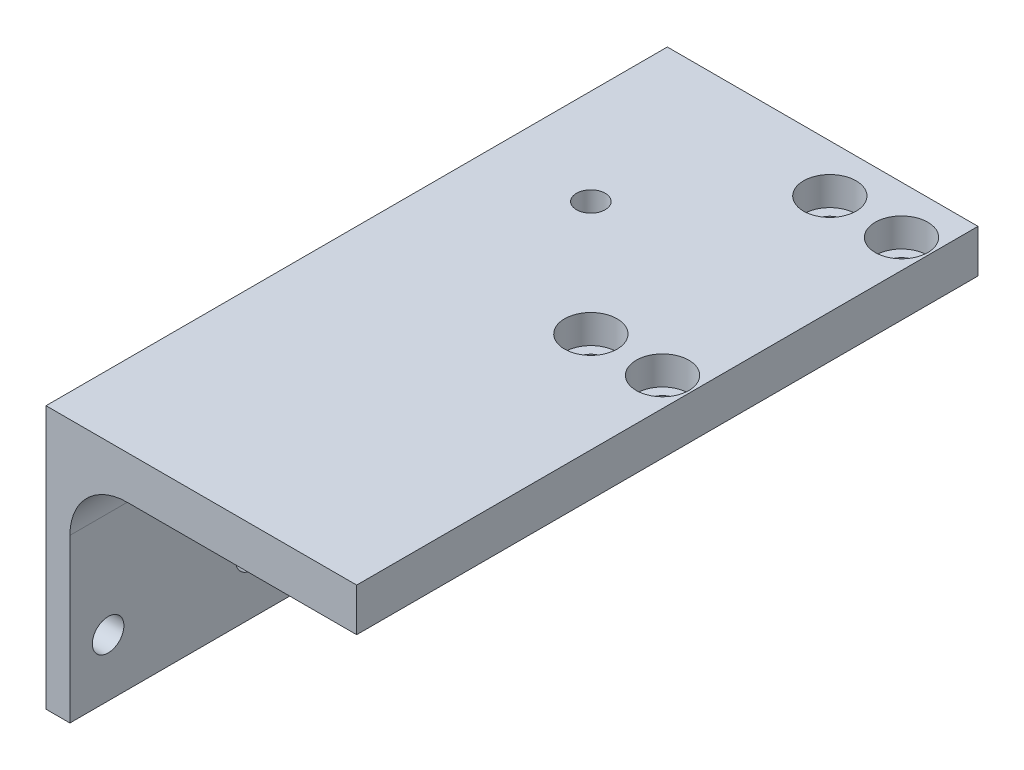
ISO-10303-21;
HEADER;
FILE_DESCRIPTION(('STEP AP214'),'2;1');
FILE_NAME('part.step','',(''),(''),'','','');
FILE_SCHEMA(('AUTOMOTIVE_DESIGN { 1 0 10303 214 1 1 1 1 }'));
ENDSEC;
DATA;
#1=APPLICATION_CONTEXT('core data for automotive mechanical design processes');
#2=APPLICATION_PROTOCOL_DEFINITION('international standard','automotive_design',2000,#1);
#3=PRODUCT_CONTEXT('',#1,'mechanical');
#4=PRODUCT('Part','Part','',(#3));
#5=PRODUCT_RELATED_PRODUCT_CATEGORY('part','',(#4));
#6=PRODUCT_DEFINITION_FORMATION('','',#4);
#7=PRODUCT_DEFINITION_CONTEXT('part definition',#1,'design');
#8=PRODUCT_DEFINITION('design','',#6,#7);
#9=PRODUCT_DEFINITION_SHAPE('','',#8);
#10=(LENGTH_UNIT() NAMED_UNIT(*) SI_UNIT(.MILLI.,.METRE.));
#11=(NAMED_UNIT(*) PLANE_ANGLE_UNIT() SI_UNIT($,.RADIAN.));
#12=(NAMED_UNIT(*) SI_UNIT($,.STERADIAN.) SOLID_ANGLE_UNIT());
#13=UNCERTAINTY_MEASURE_WITH_UNIT(LENGTH_MEASURE(1.E-05),#10,'distance_accuracy_value','');
#14=(GEOMETRIC_REPRESENTATION_CONTEXT(3) GLOBAL_UNCERTAINTY_ASSIGNED_CONTEXT((#13)) GLOBAL_UNIT_ASSIGNED_CONTEXT((#10,
#11,#12)) REPRESENTATION_CONTEXT('',''));
#15=CARTESIAN_POINT('',(0.,0.,0.));
#16=DIRECTION('',(0.,0.,1.));
#17=DIRECTION('',(1.,0.,0.));
#18=AXIS2_PLACEMENT_3D('',#15,#16,#17);
#19=CARTESIAN_POINT('',(65.,70.,65.));
#20=DIRECTION('',(-1.,0.,0.));
#21=DIRECTION('',(0.,-1.,0.));
#22=AXIS2_PLACEMENT_3D('',#19,#20,#21);
#23=PLANE('',#22);
#24=DIRECTION('',(0.,1.,0.));
#25=VECTOR('',#24,1.);
#26=CARTESIAN_POINT('',(65.,70.,-65.));
#27=LINE('',#26,#25);
#28=CARTESIAN_POINT('',(65.,61.,-65.));
#29=VERTEX_POINT('',#28);
#30=CARTESIAN_POINT('',(65.,70.,-65.));
#31=VERTEX_POINT('',#30);
#32=EDGE_CURVE('E435',#29,#31,#27,.T.);
#33=ORIENTED_EDGE('',*,*,#32,.T.);
#34=DIRECTION('',(0.,0.,-1.));
#35=VECTOR('',#34,1.);
#36=CARTESIAN_POINT('',(65.,70.,65.));
#37=LINE('',#36,#35);
#38=CARTESIAN_POINT('',(65.,70.,65.));
#39=VERTEX_POINT('',#38);
#40=EDGE_CURVE('E465',#39,#31,#37,.T.);
#41=ORIENTED_EDGE('',*,*,#40,.F.);
#42=DIRECTION('',(0.,1.,0.));
#43=VECTOR('',#42,1.);
#44=CARTESIAN_POINT('',(65.,70.,65.));
#45=LINE('',#44,#43);
#46=CARTESIAN_POINT('',(65.,61.,65.));
#47=VERTEX_POINT('',#46);
#48=EDGE_CURVE('E455',#47,#39,#45,.T.);
#49=ORIENTED_EDGE('',*,*,#48,.F.);
#50=DIRECTION('',(0.,0.,-1.));
#51=VECTOR('',#50,1.);
#52=CARTESIAN_POINT('',(65.,61.,65.));
#53=LINE('',#52,#51);
#54=EDGE_CURVE('E460',#47,#29,#53,.T.);
#55=ORIENTED_EDGE('',*,*,#54,.T.);
#56=EDGE_LOOP('',(#33,#41,#49,#55));
#57=FACE_BOUND('',#56,.T.);
#58=ADVANCED_FACE('F369',(#57),#23,.F.);
#59=CARTESIAN_POINT('',(65.,70.,65.));
#60=DIRECTION('',(0.,-1.,0.));
#61=DIRECTION('',(0.,0.,-1.));
#62=AXIS2_PLACEMENT_3D('',#59,#60,#61);
#63=PLANE('',#62);
#64=CARTESIAN_POINT('',(20.,70.0000000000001,-29.));
#65=DIRECTION('',(0.,-1.,0.));
#66=DIRECTION('',(0.,0.,-1.));
#67=AXIS2_PLACEMENT_3D('',#64,#65,#66);
#68=CIRCLE('',#67,3.);
#69=CARTESIAN_POINT('',(20.,70.0000000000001,-32.));
#70=VERTEX_POINT('',#69);
#71=EDGE_CURVE('E560',#70,#70,#68,.T.);
#72=ORIENTED_EDGE('',*,*,#71,.T.);
#73=EDGE_LOOP('',(#72));
#74=FACE_BOUND('',#73,.T.);
#75=CARTESIAN_POINT('',(59.,70.,-55.));
#76=DIRECTION('',(0.,1.,0.));
#77=DIRECTION('',(0.,0.,1.));
#78=AXIS2_PLACEMENT_3D('',#75,#76,#77);
#79=CIRCLE('',#78,5.49999999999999);
#80=CARTESIAN_POINT('',(59.,70.,-49.5));
#81=VERTEX_POINT('',#80);
#82=EDGE_CURVE('E506',#81,#81,#79,.T.);
#83=ORIENTED_EDGE('',*,*,#82,.F.);
#84=EDGE_LOOP('',(#83));
#85=FACE_BOUND('',#84,.T.);
#86=CARTESIAN_POINT('',(59.,70.,-5.));
#87=DIRECTION('',(0.,1.,0.));
#88=DIRECTION('',(0.,0.,1.));
#89=AXIS2_PLACEMENT_3D('',#86,#87,#88);
#90=CIRCLE('',#89,5.5);
#91=CARTESIAN_POINT('',(59.,70.,0.5));
#92=VERTEX_POINT('',#91);
#93=EDGE_CURVE('E493',#92,#92,#90,.T.);
#94=ORIENTED_EDGE('',*,*,#93,.F.);
#95=EDGE_LOOP('',(#94));
#96=FACE_BOUND('',#95,.T.);
#97=CARTESIAN_POINT('',(44.,70.,-5.));
#98=DIRECTION('',(0.,1.,0.));
#99=DIRECTION('',(0.,0.,1.));
#100=AXIS2_PLACEMENT_3D('',#97,#98,#99);
#101=CIRCLE('',#100,5.5);
#102=CARTESIAN_POINT('',(44.,70.,0.5));
#103=VERTEX_POINT('',#102);
#104=EDGE_CURVE('E489',#103,#103,#101,.T.);
#105=ORIENTED_EDGE('',*,*,#104,.F.);
#106=EDGE_LOOP('',(#105));
#107=FACE_BOUND('',#106,.T.);
#108=CARTESIAN_POINT('',(44.,70.,-55.));
#109=DIRECTION('',(0.,1.,0.));
#110=DIRECTION('',(0.,0.,1.));
#111=AXIS2_PLACEMENT_3D('',#108,#109,#110);
#112=CIRCLE('',#111,5.49999999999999);
#113=CARTESIAN_POINT('',(44.,70.,-49.5));
#114=VERTEX_POINT('',#113);
#115=EDGE_CURVE('E485',#114,#114,#112,.T.);
#116=ORIENTED_EDGE('',*,*,#115,.F.);
#117=EDGE_LOOP('',(#116));
#118=FACE_BOUND('',#117,.T.);
#119=DIRECTION('',(-1.,0.,0.));
#120=VECTOR('',#119,1.);
#121=CARTESIAN_POINT('',(65.,70.,-65.));
#122=LINE('',#121,#120);
#123=CARTESIAN_POINT('',(0.,70.,-65.));
#124=VERTEX_POINT('',#123);
#125=EDGE_CURVE('E531',#31,#124,#122,.T.);
#126=ORIENTED_EDGE('',*,*,#125,.T.);
#127=DIRECTION('',(0.,0.,-1.));
#128=VECTOR('',#127,1.);
#129=CARTESIAN_POINT('',(0.,70.,65.));
#130=LINE('',#129,#128);
#131=CARTESIAN_POINT('',(0.,70.,65.));
#132=VERTEX_POINT('',#131);
#133=EDGE_CURVE('E463',#132,#124,#130,.T.);
#134=ORIENTED_EDGE('',*,*,#133,.F.);
#135=DIRECTION('',(-1.,0.,0.));
#136=VECTOR('',#135,1.);
#137=CARTESIAN_POINT('',(65.,70.,65.));
#138=LINE('',#137,#136);
#139=EDGE_CURVE('E449',#39,#132,#138,.T.);
#140=ORIENTED_EDGE('',*,*,#139,.F.);
#141=ORIENTED_EDGE('',*,*,#40,.T.);
#142=EDGE_LOOP('',(#126,#134,#140,#141));
#143=FACE_BOUND('',#142,.T.);
#144=ADVANCED_FACE('F544',(#74,#85,#96,#107,#118,#143),#63,.F.);
#145=CARTESIAN_POINT('',(0.,70.,65.));
#146=DIRECTION('',(1.,0.,0.));
#147=DIRECTION('',(0.,0.,-1.));
#148=AXIS2_PLACEMENT_3D('',#145,#146,#147);
#149=PLANE('',#148);
#150=CARTESIAN_POINT('',(0.,47.,37.));
#151=DIRECTION('',(-1.,0.,0.));
#152=DIRECTION('',(0.,0.,1.));
#153=AXIS2_PLACEMENT_3D('',#150,#151,#152);
#154=CIRCLE('',#153,1.5);
#155=CARTESIAN_POINT('',(0.,47.,38.5));
#156=VERTEX_POINT('',#155);
#157=EDGE_CURVE('E566',#156,#156,#154,.T.);
#158=ORIENTED_EDGE('',*,*,#157,.F.);
#159=EDGE_LOOP('',(#158));
#160=FACE_BOUND('',#159,.T.);
#161=CARTESIAN_POINT('',(0.,27.,57.));
#162=DIRECTION('',(1.,0.,0.));
#163=DIRECTION('',(0.,0.,-1.));
#164=AXIS2_PLACEMENT_3D('',#161,#162,#163);
#165=CIRCLE('',#164,3.3);
#166=CARTESIAN_POINT('',(0.,27.,53.7));
#167=VERTEX_POINT('',#166);
#168=EDGE_CURVE('E571',#167,#167,#165,.T.);
#169=ORIENTED_EDGE('',*,*,#168,.T.);
#170=EDGE_LOOP('',(#169));
#171=FACE_BOUND('',#170,.T.);
#172=CARTESIAN_POINT('',(0.,27.,27.));
#173=DIRECTION('',(1.,0.,0.));
#174=DIRECTION('',(0.,0.,-1.));
#175=AXIS2_PLACEMENT_3D('',#172,#173,#174);
#176=CIRCLE('',#175,3.3);
#177=CARTESIAN_POINT('',(0.,27.,23.7));
#178=VERTEX_POINT('',#177);
#179=EDGE_CURVE('E577',#178,#178,#176,.T.);
#180=ORIENTED_EDGE('',*,*,#179,.T.);
#181=EDGE_LOOP('',(#180));
#182=FACE_BOUND('',#181,.T.);
#183=DIRECTION('',(0.,-1.,0.));
#184=VECTOR('',#183,1.);
#185=CARTESIAN_POINT('',(0.,70.,-65.));
#186=LINE('',#185,#184);
#187=CARTESIAN_POINT('',(0.,15.,-65.));
#188=VERTEX_POINT('',#187);
#189=EDGE_CURVE('E444',#124,#188,#186,.T.);
#190=ORIENTED_EDGE('',*,*,#189,.T.);
#191=DIRECTION('',(0.,0.,1.));
#192=VECTOR('',#191,1.);
#193=CARTESIAN_POINT('',(0.,15.,107.536267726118));
#194=LINE('',#193,#192);
#195=CARTESIAN_POINT('',(0.,15.,65.));
#196=VERTEX_POINT('',#195);
#197=EDGE_CURVE('E389',#188,#196,#194,.T.);
#198=ORIENTED_EDGE('',*,*,#197,.T.);
#199=DIRECTION('',(0.,-1.,0.));
#200=VECTOR('',#199,1.);
#201=CARTESIAN_POINT('',(0.,70.,65.));
#202=LINE('',#201,#200);
#203=EDGE_CURVE('E442',#132,#196,#202,.T.);
#204=ORIENTED_EDGE('',*,*,#203,.F.);
#205=ORIENTED_EDGE('',*,*,#133,.T.);
#206=EDGE_LOOP('',(#190,#198,#204,#205));
#207=FACE_BOUND('',#206,.T.);
#208=ADVANCED_FACE('F440',(#160,#171,#182,#207),#149,.F.);
#209=CARTESIAN_POINT('',(5.00000000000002,61.,65.));
#210=DIRECTION('',(-1.,0.,0.));
#211=DIRECTION('',(0.,0.,1.));
#212=AXIS2_PLACEMENT_3D('',#209,#210,#211);
#213=PLANE('',#212);
#214=CARTESIAN_POINT('',(5.00000000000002,47.,37.));
#215=DIRECTION('',(-1.,0.,0.));
#216=DIRECTION('',(0.,0.,1.));
#217=AXIS2_PLACEMENT_3D('',#214,#215,#216);
#218=CIRCLE('',#217,1.5);
#219=CARTESIAN_POINT('',(5.00000000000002,47.,38.5));
#220=VERTEX_POINT('',#219);
#221=EDGE_CURVE('E372',#220,#220,#218,.T.);
#222=ORIENTED_EDGE('',*,*,#221,.T.);
#223=EDGE_LOOP('',(#222));
#224=FACE_BOUND('',#223,.T.);
#225=CARTESIAN_POINT('',(5.00000000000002,27.,57.));
#226=DIRECTION('',(1.,0.,0.));
#227=DIRECTION('',(0.,0.,-1.));
#228=AXIS2_PLACEMENT_3D('',#225,#226,#227);
#229=CIRCLE('',#228,3.3);
#230=CARTESIAN_POINT('',(5.00000000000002,27.,53.7));
#231=VERTEX_POINT('',#230);
#232=EDGE_CURVE('E563',#231,#231,#229,.T.);
#233=ORIENTED_EDGE('',*,*,#232,.F.);
#234=EDGE_LOOP('',(#233));
#235=FACE_BOUND('',#234,.T.);
#236=CARTESIAN_POINT('',(5.00000000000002,27.,27.));
#237=DIRECTION('',(1.,0.,0.));
#238=DIRECTION('',(0.,0.,-1.));
#239=AXIS2_PLACEMENT_3D('',#236,#237,#238);
#240=CIRCLE('',#239,3.3);
#241=CARTESIAN_POINT('',(5.00000000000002,27.,23.7));
#242=VERTEX_POINT('',#241);
#243=EDGE_CURVE('E574',#242,#242,#240,.T.);
#244=ORIENTED_EDGE('',*,*,#243,.F.);
#245=EDGE_LOOP('',(#244));
#246=FACE_BOUND('',#245,.T.);
#247=DIRECTION('',(0.,1.,0.));
#248=VECTOR('',#247,1.);
#249=CARTESIAN_POINT('',(5.00000000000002,61.,65.));
#250=LINE('',#249,#248);
#251=CARTESIAN_POINT('',(5.00000000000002,15.,65.));
#252=VERTEX_POINT('',#251);
#253=CARTESIAN_POINT('',(5.00000000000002,49.,65.));
#254=VERTEX_POINT('',#253);
#255=EDGE_CURVE('E451',#252,#254,#250,.T.);
#256=ORIENTED_EDGE('',*,*,#255,.F.);
#257=DIRECTION('',(0.,0.,-1.));
#258=VECTOR('',#257,1.);
#259=CARTESIAN_POINT('',(5.00000000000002,15.,65.));
#260=LINE('',#259,#258);
#261=CARTESIAN_POINT('',(5.00000000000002,15.,-65.));
#262=VERTEX_POINT('',#261);
#263=EDGE_CURVE('E431',#252,#262,#260,.T.);
#264=ORIENTED_EDGE('',*,*,#263,.T.);
#265=DIRECTION('',(0.,1.,0.));
#266=VECTOR('',#265,1.);
#267=CARTESIAN_POINT('',(5.00000000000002,61.,-65.));
#268=LINE('',#267,#266);
#269=CARTESIAN_POINT('',(5.00000000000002,49.,-65.));
#270=VERTEX_POINT('',#269);
#271=EDGE_CURVE('E534',#262,#270,#268,.T.);
#272=ORIENTED_EDGE('',*,*,#271,.T.);
#273=DIRECTION('',(0.,0.,-1.));
#274=VECTOR('',#273,1.);
#275=CARTESIAN_POINT('',(5.00000000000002,49.,65.));
#276=LINE('',#275,#274);
#277=EDGE_CURVE('E468',#270,#254,#276,.F.);
#278=ORIENTED_EDGE('',*,*,#277,.T.);
#279=EDGE_LOOP('',(#256,#264,#272,#278));
#280=FACE_BOUND('',#279,.T.);
#281=ADVANCED_FACE('F549',(#224,#235,#246,#280),#213,.F.);
#282=CARTESIAN_POINT('',(65.,61.,65.));
#283=DIRECTION('',(0.,1.,0.));
#284=DIRECTION('',(-1.,0.,0.));
#285=AXIS2_PLACEMENT_3D('',#282,#283,#284);
#286=PLANE('',#285);
#287=CARTESIAN_POINT('',(59.,61.,-55.));
#288=DIRECTION('',(0.,1.,0.));
#289=DIRECTION('',(-1.,0.,0.));
#290=AXIS2_PLACEMENT_3D('',#287,#288,#289);
#291=CIRCLE('',#290,3.29999999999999);
#292=CARTESIAN_POINT('',(55.7,61.,-55.));
#293=VERTEX_POINT('',#292);
#294=EDGE_CURVE('E491',#293,#293,#291,.T.);
#295=ORIENTED_EDGE('',*,*,#294,.T.);
#296=EDGE_LOOP('',(#295));
#297=FACE_BOUND('',#296,.T.);
#298=CARTESIAN_POINT('',(59.,61.,-5.));
#299=DIRECTION('',(0.,1.,0.));
#300=DIRECTION('',(-1.,0.,0.));
#301=AXIS2_PLACEMENT_3D('',#298,#299,#300);
#302=CIRCLE('',#301,3.29999999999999);
#303=CARTESIAN_POINT('',(55.7,61.,-5.));
#304=VERTEX_POINT('',#303);
#305=EDGE_CURVE('E487',#304,#304,#302,.T.);
#306=ORIENTED_EDGE('',*,*,#305,.T.);
#307=EDGE_LOOP('',(#306));
#308=FACE_BOUND('',#307,.T.);
#309=CARTESIAN_POINT('',(44.,61.,-5.));
#310=DIRECTION('',(0.,1.,0.));
#311=DIRECTION('',(-1.,0.,0.));
#312=AXIS2_PLACEMENT_3D('',#309,#310,#311);
#313=CIRCLE('',#312,3.29999999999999);
#314=CARTESIAN_POINT('',(40.7,61.,-5.));
#315=VERTEX_POINT('',#314);
#316=EDGE_CURVE('E482',#315,#315,#313,.T.);
#317=ORIENTED_EDGE('',*,*,#316,.T.);
#318=EDGE_LOOP('',(#317));
#319=FACE_BOUND('',#318,.T.);
#320=CARTESIAN_POINT('',(44.,61.,-55.));
#321=DIRECTION('',(0.,1.,0.));
#322=DIRECTION('',(-1.,0.,0.));
#323=AXIS2_PLACEMENT_3D('',#320,#321,#322);
#324=CIRCLE('',#323,3.29999999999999);
#325=CARTESIAN_POINT('',(40.7,61.,-55.));
#326=VERTEX_POINT('',#325);
#327=EDGE_CURVE('E445',#326,#326,#324,.T.);
#328=ORIENTED_EDGE('',*,*,#327,.T.);
#329=EDGE_LOOP('',(#328));
#330=FACE_BOUND('',#329,.T.);
#331=DIRECTION('',(0.,0.,-1.));
#332=VECTOR('',#331,1.);
#333=CARTESIAN_POINT('',(17.,61.,-65.));
#334=LINE('',#333,#332);
#335=CARTESIAN_POINT('',(17.,61.,65.));
#336=VERTEX_POINT('',#335);
#337=CARTESIAN_POINT('',(17.,61.,-29.));
#338=VERTEX_POINT('',#337);
#339=EDGE_CURVE('E472',#336,#338,#334,.T.);
#340=ORIENTED_EDGE('',*,*,#339,.T.);
#341=CARTESIAN_POINT('',(20.,61.,-29.));
#342=DIRECTION('',(0.,-1.,0.));
#343=DIRECTION('',(0.,0.,-1.));
#344=AXIS2_PLACEMENT_3D('',#341,#342,#343);
#345=CIRCLE('',#344,3.);
#346=EDGE_CURVE('E383',#338,#338,#345,.T.);
#347=ORIENTED_EDGE('',*,*,#346,.F.);
#348=CARTESIAN_POINT('',(17.,61.,-65.));
#349=VERTEX_POINT('',#348);
#350=EDGE_CURVE('E471',#338,#349,#334,.T.);
#351=ORIENTED_EDGE('',*,*,#350,.T.);
#352=DIRECTION('',(1.,0.,0.));
#353=VECTOR('',#352,1.);
#354=CARTESIAN_POINT('',(65.,61.,-65.));
#355=LINE('',#354,#353);
#356=EDGE_CURVE('E536',#349,#29,#355,.T.);
#357=ORIENTED_EDGE('',*,*,#356,.T.);
#358=ORIENTED_EDGE('',*,*,#54,.F.);
#359=DIRECTION('',(1.,0.,0.));
#360=VECTOR('',#359,1.);
#361=CARTESIAN_POINT('',(65.,61.,65.));
#362=LINE('',#361,#360);
#363=EDGE_CURVE('E453',#336,#47,#362,.T.);
#364=ORIENTED_EDGE('',*,*,#363,.F.);
#365=EDGE_LOOP('',(#340,#347,#351,#357,#358,#364));
#366=FACE_BOUND('',#365,.T.);
#367=ADVANCED_FACE('F555',(#297,#308,#319,#330,#366),#286,.F.);
#368=CARTESIAN_POINT('',(65.0000000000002,-61.,65.));
#369=DIRECTION('',(0.,0.,-1.));
#370=DIRECTION('',(-1.,0.,0.));
#371=AXIS2_PLACEMENT_3D('',#368,#369,#370);
#372=PLANE('',#371);
#373=ORIENTED_EDGE('',*,*,#203,.T.);
#374=DIRECTION('',(1.,0.,0.));
#375=VECTOR('',#374,1.);
#376=CARTESIAN_POINT('',(65.0000000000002,15.,65.));
#377=LINE('',#376,#375);
#378=EDGE_CURVE('E428',#196,#252,#377,.T.);
#379=ORIENTED_EDGE('',*,*,#378,.T.);
#380=ORIENTED_EDGE('',*,*,#255,.T.);
#381=CARTESIAN_POINT('',(17.,49.,65.));
#382=DIRECTION('',(0.,0.,-1.));
#383=DIRECTION('',(-1.,0.,0.));
#384=AXIS2_PLACEMENT_3D('',#381,#382,#383);
#385=CIRCLE('',#384,12.);
#386=EDGE_CURVE('E377',#254,#336,#385,.T.);
#387=ORIENTED_EDGE('',*,*,#386,.T.);
#388=ORIENTED_EDGE('',*,*,#363,.T.);
#389=ORIENTED_EDGE('',*,*,#48,.T.);
#390=ORIENTED_EDGE('',*,*,#139,.T.);
#391=EDGE_LOOP('',(#373,#379,#380,#387,#388,#389,#390));
#392=FACE_BOUND('',#391,.T.);
#393=ADVANCED_FACE('F447',(#392),#372,.F.);
#394=CARTESIAN_POINT('',(65.0000000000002,-61.,-65.));
#395=DIRECTION('',(0.,0.,-1.));
#396=DIRECTION('',(-1.,0.,0.));
#397=AXIS2_PLACEMENT_3D('',#394,#395,#396);
#398=PLANE('',#397);
#399=DIRECTION('',(1.,0.,0.));
#400=VECTOR('',#399,1.);
#401=CARTESIAN_POINT('',(65.0000000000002,15.,-65.));
#402=LINE('',#401,#400);
#403=EDGE_CURVE('E11',#188,#262,#402,.T.);
#404=ORIENTED_EDGE('',*,*,#403,.F.);
#405=ORIENTED_EDGE('',*,*,#189,.F.);
#406=ORIENTED_EDGE('',*,*,#125,.F.);
#407=ORIENTED_EDGE('',*,*,#32,.F.);
#408=ORIENTED_EDGE('',*,*,#356,.F.);
#409=CARTESIAN_POINT('',(17.,49.,-65.));
#410=DIRECTION('',(0.,0.,-1.));
#411=DIRECTION('',(-1.,0.,0.));
#412=AXIS2_PLACEMENT_3D('',#409,#410,#411);
#413=CIRCLE('',#412,12.);
#414=EDGE_CURVE('E475',#349,#270,#413,.F.);
#415=ORIENTED_EDGE('',*,*,#414,.T.);
#416=ORIENTED_EDGE('',*,*,#271,.F.);
#417=EDGE_LOOP('',(#404,#405,#406,#407,#408,#415,#416));
#418=FACE_BOUND('',#417,.T.);
#419=ADVANCED_FACE('F546',(#418),#398,.T.);
#420=CARTESIAN_POINT('',(17.,49.,65.));
#421=DIRECTION('',(0.,0.,1.));
#422=DIRECTION('',(1.,0.,0.));
#423=AXIS2_PLACEMENT_3D('',#420,#421,#422);
#424=CYLINDRICAL_SURFACE('',#423,12.);
#425=ORIENTED_EDGE('',*,*,#386,.F.);
#426=ORIENTED_EDGE('',*,*,#277,.F.);
#427=ORIENTED_EDGE('',*,*,#414,.F.);
#428=ORIENTED_EDGE('',*,*,#350,.F.);
#429=ORIENTED_EDGE('',*,*,#339,.F.);
#430=EDGE_LOOP('',(#425,#426,#427,#428,#429));
#431=FACE_BOUND('',#430,.T.);
#432=ADVANCED_FACE('F557',(#431),#424,.F.);
#433=CARTESIAN_POINT('',(0.,15.,107.536267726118));
#434=DIRECTION('',(0.,1.,0.));
#435=DIRECTION('',(0.,0.,1.));
#436=AXIS2_PLACEMENT_3D('',#433,#434,#435);
#437=PLANE('',#436);
#438=ORIENTED_EDGE('',*,*,#197,.F.);
#439=ORIENTED_EDGE('',*,*,#403,.T.);
#440=ORIENTED_EDGE('',*,*,#263,.F.);
#441=ORIENTED_EDGE('',*,*,#378,.F.);
#442=EDGE_LOOP('',(#438,#439,#440,#441));
#443=FACE_BOUND('',#442,.T.);
#444=ADVANCED_FACE('F429',(#443),#437,.F.);
#445=CARTESIAN_POINT('',(44.,70.,-55.));
#446=DIRECTION('',(0.,1.,0.));
#447=DIRECTION('',(0.,0.,1.));
#448=AXIS2_PLACEMENT_3D('',#445,#446,#447);
#449=CYLINDRICAL_SURFACE('',#448,3.29999999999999);
#450=CARTESIAN_POINT('',(44.,64.,-55.));
#451=DIRECTION('',(0.,1.,0.));
#452=DIRECTION('',(0.,0.,1.));
#453=AXIS2_PLACEMENT_3D('',#450,#451,#452);
#454=CIRCLE('',#453,3.3);
#455=CARTESIAN_POINT('',(44.,64.,-51.7));
#456=VERTEX_POINT('',#455);
#457=EDGE_CURVE('E481',#456,#456,#454,.T.);
#458=ORIENTED_EDGE('',*,*,#457,.T.);
#459=EDGE_LOOP('',(#458));
#460=FACE_BOUND('',#459,.T.);
#461=ORIENTED_EDGE('',*,*,#327,.F.);
#462=EDGE_LOOP('',(#461));
#463=FACE_BOUND('',#462,.T.);
#464=ADVANCED_FACE('F606',(#460,#463),#449,.F.);
#465=CARTESIAN_POINT('',(47.3,64.,-55.));
#466=DIRECTION('',(0.,-1.,0.));
#467=DIRECTION('',(0.,0.,-1.));
#468=AXIS2_PLACEMENT_3D('',#465,#466,#467);
#469=PLANE('',#468);
#470=ORIENTED_EDGE('',*,*,#457,.F.);
#471=EDGE_LOOP('',(#470));
#472=FACE_BOUND('',#471,.T.);
#473=CARTESIAN_POINT('',(44.,64.,-55.));
#474=DIRECTION('',(0.,1.,0.));
#475=DIRECTION('',(0.,0.,1.));
#476=AXIS2_PLACEMENT_3D('',#473,#474,#475);
#477=CIRCLE('',#476,5.5);
#478=CARTESIAN_POINT('',(44.,64.,-49.5));
#479=VERTEX_POINT('',#478);
#480=EDGE_CURVE('E523',#479,#479,#477,.T.);
#481=ORIENTED_EDGE('',*,*,#480,.T.);
#482=EDGE_LOOP('',(#481));
#483=FACE_BOUND('',#482,.T.);
#484=ADVANCED_FACE('F596',(#472,#483),#469,.F.);
#485=CARTESIAN_POINT('',(44.,70.,-55.));
#486=DIRECTION('',(0.,1.,0.));
#487=DIRECTION('',(0.,0.,1.));
#488=AXIS2_PLACEMENT_3D('',#485,#486,#487);
#489=CYLINDRICAL_SURFACE('',#488,5.49999999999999);
#490=ORIENTED_EDGE('',*,*,#480,.F.);
#491=EDGE_LOOP('',(#490));
#492=FACE_BOUND('',#491,.T.);
#493=ORIENTED_EDGE('',*,*,#115,.T.);
#494=EDGE_LOOP('',(#493));
#495=FACE_BOUND('',#494,.T.);
#496=ADVANCED_FACE('F593',(#492,#495),#489,.F.);
#497=CARTESIAN_POINT('',(44.,70.,-5.));
#498=DIRECTION('',(0.,1.,0.));
#499=DIRECTION('',(0.,0.,1.));
#500=AXIS2_PLACEMENT_3D('',#497,#498,#499);
#501=CYLINDRICAL_SURFACE('',#500,3.29999999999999);
#502=CARTESIAN_POINT('',(44.,64.,-5.));
#503=DIRECTION('',(0.,1.,0.));
#504=DIRECTION('',(0.,0.,1.));
#505=AXIS2_PLACEMENT_3D('',#502,#503,#504);
#506=CIRCLE('',#505,3.3);
#507=CARTESIAN_POINT('',(44.,64.,-1.7));
#508=VERTEX_POINT('',#507);
#509=EDGE_CURVE('E486',#508,#508,#506,.T.);
#510=ORIENTED_EDGE('',*,*,#509,.T.);
#511=EDGE_LOOP('',(#510));
#512=FACE_BOUND('',#511,.T.);
#513=ORIENTED_EDGE('',*,*,#316,.F.);
#514=EDGE_LOOP('',(#513));
#515=FACE_BOUND('',#514,.T.);
#516=ADVANCED_FACE('F595',(#512,#515),#501,.F.);
#517=CARTESIAN_POINT('',(47.3,64.,-5.));
#518=DIRECTION('',(0.,-1.,0.));
#519=DIRECTION('',(0.,0.,-1.));
#520=AXIS2_PLACEMENT_3D('',#517,#518,#519);
#521=PLANE('',#520);
#522=ORIENTED_EDGE('',*,*,#509,.F.);
#523=EDGE_LOOP('',(#522));
#524=FACE_BOUND('',#523,.T.);
#525=CARTESIAN_POINT('',(44.,64.,-5.));
#526=DIRECTION('',(0.,1.,0.));
#527=DIRECTION('',(0.,0.,1.));
#528=AXIS2_PLACEMENT_3D('',#525,#526,#527);
#529=CIRCLE('',#528,5.5);
#530=CARTESIAN_POINT('',(44.,64.,0.5));
#531=VERTEX_POINT('',#530);
#532=EDGE_CURVE('E516',#531,#531,#529,.T.);
#533=ORIENTED_EDGE('',*,*,#532,.T.);
#534=EDGE_LOOP('',(#533));
#535=FACE_BOUND('',#534,.T.);
#536=ADVANCED_FACE('F603',(#524,#535),#521,.F.);
#537=CARTESIAN_POINT('',(44.,70.,-5.));
#538=DIRECTION('',(0.,1.,0.));
#539=DIRECTION('',(0.,0.,1.));
#540=AXIS2_PLACEMENT_3D('',#537,#538,#539);
#541=CYLINDRICAL_SURFACE('',#540,5.5);
#542=ORIENTED_EDGE('',*,*,#532,.F.);
#543=EDGE_LOOP('',(#542));
#544=FACE_BOUND('',#543,.T.);
#545=ORIENTED_EDGE('',*,*,#104,.T.);
#546=EDGE_LOOP('',(#545));
#547=FACE_BOUND('',#546,.T.);
#548=ADVANCED_FACE('F658',(#544,#547),#541,.F.);
#549=CARTESIAN_POINT('',(59.,70.,-5.));
#550=DIRECTION('',(0.,1.,0.));
#551=DIRECTION('',(0.,0.,1.));
#552=AXIS2_PLACEMENT_3D('',#549,#550,#551);
#553=CYLINDRICAL_SURFACE('',#552,3.29999999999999);
#554=CARTESIAN_POINT('',(59.,64.,-5.));
#555=DIRECTION('',(0.,1.,0.));
#556=DIRECTION('',(0.,0.,1.));
#557=AXIS2_PLACEMENT_3D('',#554,#555,#556);
#558=CIRCLE('',#557,3.3);
#559=CARTESIAN_POINT('',(59.,64.,-1.7));
#560=VERTEX_POINT('',#559);
#561=EDGE_CURVE('E490',#560,#560,#558,.T.);
#562=ORIENTED_EDGE('',*,*,#561,.T.);
#563=EDGE_LOOP('',(#562));
#564=FACE_BOUND('',#563,.T.);
#565=ORIENTED_EDGE('',*,*,#305,.F.);
#566=EDGE_LOOP('',(#565));
#567=FACE_BOUND('',#566,.T.);
#568=ADVANCED_FACE('F666',(#564,#567),#553,.F.);
#569=CARTESIAN_POINT('',(62.3,64.,-5.));
#570=DIRECTION('',(0.,-1.,0.));
#571=DIRECTION('',(0.,0.,-1.));
#572=AXIS2_PLACEMENT_3D('',#569,#570,#571);
#573=PLANE('',#572);
#574=ORIENTED_EDGE('',*,*,#561,.F.);
#575=EDGE_LOOP('',(#574));
#576=FACE_BOUND('',#575,.T.);
#577=CARTESIAN_POINT('',(59.,64.,-5.));
#578=DIRECTION('',(0.,1.,0.));
#579=DIRECTION('',(0.,0.,1.));
#580=AXIS2_PLACEMENT_3D('',#577,#578,#579);
#581=CIRCLE('',#580,5.5);
#582=CARTESIAN_POINT('',(59.,64.,0.5));
#583=VERTEX_POINT('',#582);
#584=EDGE_CURVE('E498',#583,#583,#581,.T.);
#585=ORIENTED_EDGE('',*,*,#584,.T.);
#586=EDGE_LOOP('',(#585));
#587=FACE_BOUND('',#586,.T.);
#588=ADVANCED_FACE('F674',(#576,#587),#573,.F.);
#589=CARTESIAN_POINT('',(59.,70.,-5.));
#590=DIRECTION('',(0.,1.,0.));
#591=DIRECTION('',(0.,0.,1.));
#592=AXIS2_PLACEMENT_3D('',#589,#590,#591);
#593=CYLINDRICAL_SURFACE('',#592,5.5);
#594=ORIENTED_EDGE('',*,*,#584,.F.);
#595=EDGE_LOOP('',(#594));
#596=FACE_BOUND('',#595,.T.);
#597=ORIENTED_EDGE('',*,*,#93,.T.);
#598=EDGE_LOOP('',(#597));
#599=FACE_BOUND('',#598,.T.);
#600=ADVANCED_FACE('F682',(#596,#599),#593,.F.);
#601=CARTESIAN_POINT('',(59.,70.,-55.));
#602=DIRECTION('',(0.,1.,0.));
#603=DIRECTION('',(0.,0.,1.));
#604=AXIS2_PLACEMENT_3D('',#601,#602,#603);
#605=CYLINDRICAL_SURFACE('',#604,3.29999999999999);
#606=CARTESIAN_POINT('',(59.,64.,-55.));
#607=DIRECTION('',(0.,1.,0.));
#608=DIRECTION('',(0.,0.,1.));
#609=AXIS2_PLACEMENT_3D('',#606,#607,#608);
#610=CIRCLE('',#609,3.3);
#611=CARTESIAN_POINT('',(59.,64.,-51.7));
#612=VERTEX_POINT('',#611);
#613=EDGE_CURVE('E494',#612,#612,#610,.T.);
#614=ORIENTED_EDGE('',*,*,#613,.T.);
#615=EDGE_LOOP('',(#614));
#616=FACE_BOUND('',#615,.T.);
#617=ORIENTED_EDGE('',*,*,#294,.F.);
#618=EDGE_LOOP('',(#617));
#619=FACE_BOUND('',#618,.T.);
#620=ADVANCED_FACE('F690',(#616,#619),#605,.F.);
#621=CARTESIAN_POINT('',(62.3,64.,-55.));
#622=DIRECTION('',(0.,-1.,0.));
#623=DIRECTION('',(0.,0.,-1.));
#624=AXIS2_PLACEMENT_3D('',#621,#622,#623);
#625=PLANE('',#624);
#626=ORIENTED_EDGE('',*,*,#613,.F.);
#627=EDGE_LOOP('',(#626));
#628=FACE_BOUND('',#627,.T.);
#629=CARTESIAN_POINT('',(59.,64.,-55.));
#630=DIRECTION('',(0.,1.,0.));
#631=DIRECTION('',(0.,0.,1.));
#632=AXIS2_PLACEMENT_3D('',#629,#630,#631);
#633=CIRCLE('',#632,5.49999999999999);
#634=CARTESIAN_POINT('',(59.,64.,-49.5));
#635=VERTEX_POINT('',#634);
#636=EDGE_CURVE('E501',#635,#635,#633,.T.);
#637=ORIENTED_EDGE('',*,*,#636,.T.);
#638=EDGE_LOOP('',(#637));
#639=FACE_BOUND('',#638,.T.);
#640=ADVANCED_FACE('F698',(#628,#639),#625,.F.);
#641=CARTESIAN_POINT('',(59.,70.,-55.));
#642=DIRECTION('',(0.,1.,0.));
#643=DIRECTION('',(0.,0.,1.));
#644=AXIS2_PLACEMENT_3D('',#641,#642,#643);
#645=CYLINDRICAL_SURFACE('',#644,5.49999999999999);
#646=ORIENTED_EDGE('',*,*,#636,.F.);
#647=EDGE_LOOP('',(#646));
#648=FACE_BOUND('',#647,.T.);
#649=ORIENTED_EDGE('',*,*,#82,.T.);
#650=EDGE_LOOP('',(#649));
#651=FACE_BOUND('',#650,.T.);
#652=ADVANCED_FACE('F582',(#648,#651),#645,.F.);
#653=CARTESIAN_POINT('',(5.00000000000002,27.,27.));
#654=DIRECTION('',(1.,0.,0.));
#655=DIRECTION('',(0.,0.,-1.));
#656=AXIS2_PLACEMENT_3D('',#653,#654,#655);
#657=CYLINDRICAL_SURFACE('',#656,3.3);
#658=ORIENTED_EDGE('',*,*,#243,.T.);
#659=EDGE_LOOP('',(#658));
#660=FACE_BOUND('',#659,.T.);
#661=ORIENTED_EDGE('',*,*,#179,.F.);
#662=EDGE_LOOP('',(#661));
#663=FACE_BOUND('',#662,.T.);
#664=ADVANCED_FACE('F712',(#660,#663),#657,.F.);
#665=CARTESIAN_POINT('',(5.00000000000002,27.,57.));
#666=DIRECTION('',(1.,0.,0.));
#667=DIRECTION('',(0.,0.,-1.));
#668=AXIS2_PLACEMENT_3D('',#665,#666,#667);
#669=CYLINDRICAL_SURFACE('',#668,3.3);
#670=ORIENTED_EDGE('',*,*,#232,.T.);
#671=EDGE_LOOP('',(#670));
#672=FACE_BOUND('',#671,.T.);
#673=ORIENTED_EDGE('',*,*,#168,.F.);
#674=EDGE_LOOP('',(#673));
#675=FACE_BOUND('',#674,.T.);
#676=ADVANCED_FACE('F720',(#672,#675),#669,.F.);
#677=CARTESIAN_POINT('',(20.,70.0000000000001,-29.));
#678=DIRECTION('',(0.,-1.,0.));
#679=DIRECTION('',(0.,0.,-1.));
#680=AXIS2_PLACEMENT_3D('',#677,#678,#679);
#681=CYLINDRICAL_SURFACE('',#680,3.);
#682=ORIENTED_EDGE('',*,*,#71,.F.);
#683=EDGE_LOOP('',(#682));
#684=FACE_BOUND('',#683,.T.);
#685=ORIENTED_EDGE('',*,*,#346,.T.);
#686=EDGE_LOOP('',(#685));
#687=FACE_BOUND('',#686,.T.);
#688=ADVANCED_FACE('F728',(#684,#687),#681,.F.);
#689=CARTESIAN_POINT('',(65.,47.,37.));
#690=DIRECTION('',(-1.,0.,0.));
#691=DIRECTION('',(0.,0.,1.));
#692=AXIS2_PLACEMENT_3D('',#689,#690,#691);
#693=CYLINDRICAL_SURFACE('',#692,1.5);
#694=ORIENTED_EDGE('',*,*,#157,.T.);
#695=EDGE_LOOP('',(#694));
#696=FACE_BOUND('',#695,.T.);
#697=ORIENTED_EDGE('',*,*,#221,.F.);
#698=EDGE_LOOP('',(#697));
#699=FACE_BOUND('',#698,.T.);
#700=ADVANCED_FACE('F736',(#696,#699),#693,.F.);
#701=CLOSED_SHELL('',(#58,#144,#208,#281,#367,#393,#419,#432,#444,#464,#484,#496,#516,#536,#548,
#568,#588,#600,#620,#640,#652,#664,#676,#688,#700));
#702=MANIFOLD_SOLID_BREP('B2',#701);
#703=ADVANCED_BREP_SHAPE_REPRESENTATION('',(#18,#702),#14);
#704=SHAPE_DEFINITION_REPRESENTATION(#9,#703);
ENDSEC;
END-ISO-10303-21;
